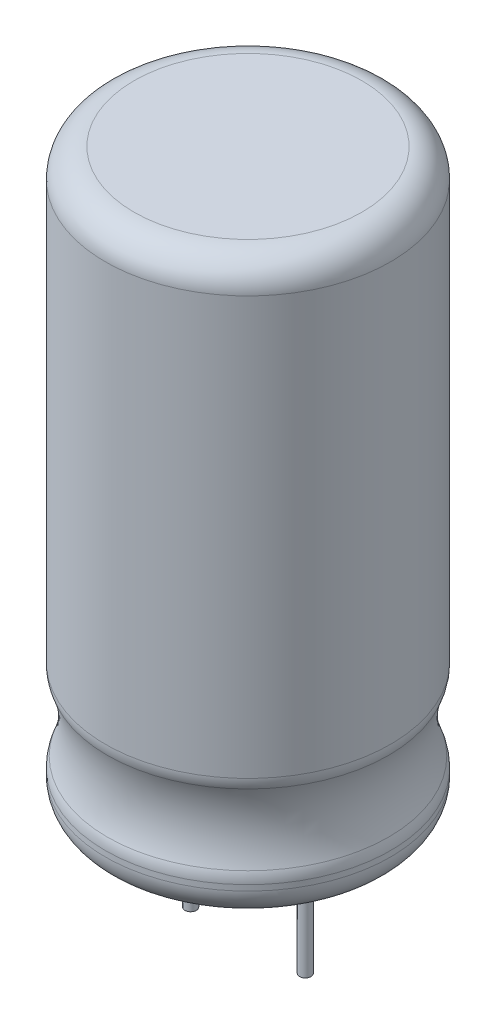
ISO-10303-21;
HEADER;
FILE_DESCRIPTION(('STEP AP214'),'2;1');
FILE_NAME('part.step','',(''),(''),'','','');
FILE_SCHEMA(('AUTOMOTIVE_DESIGN { 1 0 10303 214 1 1 1 1 }'));
ENDSEC;
DATA;
#1=APPLICATION_CONTEXT('core data for automotive mechanical design processes');
#2=APPLICATION_PROTOCOL_DEFINITION('international standard','automotive_design',2000,#1);
#3=PRODUCT_CONTEXT('',#1,'mechanical');
#4=PRODUCT('Part','Part','',(#3));
#5=PRODUCT_RELATED_PRODUCT_CATEGORY('part','',(#4));
#6=PRODUCT_DEFINITION_FORMATION('','',#4);
#7=PRODUCT_DEFINITION_CONTEXT('part definition',#1,'design');
#8=PRODUCT_DEFINITION('design','',#6,#7);
#9=PRODUCT_DEFINITION_SHAPE('','',#8);
#10=(LENGTH_UNIT() NAMED_UNIT(*) SI_UNIT(.MILLI.,.METRE.));
#11=(NAMED_UNIT(*) PLANE_ANGLE_UNIT() SI_UNIT($,.RADIAN.));
#12=(NAMED_UNIT(*) SI_UNIT($,.STERADIAN.) SOLID_ANGLE_UNIT());
#13=UNCERTAINTY_MEASURE_WITH_UNIT(LENGTH_MEASURE(1.E-05),#10,'distance_accuracy_value','');
#14=(GEOMETRIC_REPRESENTATION_CONTEXT(3) GLOBAL_UNCERTAINTY_ASSIGNED_CONTEXT((#13)) GLOBAL_UNIT_ASSIGNED_CONTEXT((#10,
#11,#12)) REPRESENTATION_CONTEXT('',''));
#15=CARTESIAN_POINT('',(0.,0.,0.));
#16=DIRECTION('',(0.,0.,1.));
#17=DIRECTION('',(1.,0.,0.));
#18=AXIS2_PLACEMENT_3D('',#15,#16,#17);
#19=CARTESIAN_POINT('',(-2.54,-5.08,0.));
#20=DIRECTION('',(0.,-1.,0.));
#21=DIRECTION('',(0.,0.,-1.));
#22=AXIS2_PLACEMENT_3D('',#19,#20,#21);
#23=PLANE('',#22);
#24=CARTESIAN_POINT('',(-2.54,-5.08,0.));
#25=DIRECTION('',(0.,1.,0.));
#26=DIRECTION('',(0.,0.,1.));
#27=AXIS2_PLACEMENT_3D('',#24,#25,#26);
#28=CIRCLE('',#27,0.254000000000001);
#29=CARTESIAN_POINT('',(-2.54,-5.08,0.254000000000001));
#30=VERTEX_POINT('',#29);
#31=EDGE_CURVE('E144',#30,#30,#28,.T.);
#32=ORIENTED_EDGE('',*,*,#31,.F.);
#33=EDGE_LOOP('',(#32));
#34=FACE_BOUND('',#33,.T.);
#35=ADVANCED_FACE('F14',(#34),#23,.T.);
#36=CARTESIAN_POINT('',(2.54,-5.08,0.));
#37=DIRECTION('',(0.,-1.,0.));
#38=DIRECTION('',(0.,0.,-1.));
#39=AXIS2_PLACEMENT_3D('',#36,#37,#38);
#40=PLANE('',#39);
#41=CARTESIAN_POINT('',(2.54,-5.08,0.));
#42=DIRECTION('',(0.,1.,0.));
#43=DIRECTION('',(0.,0.,1.));
#44=AXIS2_PLACEMENT_3D('',#41,#42,#43);
#45=CIRCLE('',#44,0.254000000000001);
#46=CARTESIAN_POINT('',(2.54,-5.08,0.254000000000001));
#47=VERTEX_POINT('',#46);
#48=EDGE_CURVE('E141',#47,#47,#45,.T.);
#49=ORIENTED_EDGE('',*,*,#48,.F.);
#50=EDGE_LOOP('',(#49));
#51=FACE_BOUND('',#50,.T.);
#52=ADVANCED_FACE('F339',(#51),#40,.T.);
#53=CARTESIAN_POINT('',(-2.54,-5.08,0.));
#54=DIRECTION('',(0.,1.,0.));
#55=DIRECTION('',(0.,0.,1.));
#56=AXIS2_PLACEMENT_3D('',#53,#54,#55);
#57=CYLINDRICAL_SURFACE('',#56,0.254000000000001);
#58=CARTESIAN_POINT('',(-2.54,0.,0.));
#59=DIRECTION('',(0.,1.,0.));
#60=DIRECTION('',(0.,0.,1.));
#61=AXIS2_PLACEMENT_3D('',#58,#59,#60);
#62=CIRCLE('',#61,0.254000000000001);
#63=CARTESIAN_POINT('',(-2.54,0.,0.254000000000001));
#64=VERTEX_POINT('',#63);
#65=EDGE_CURVE('E74',#64,#64,#62,.T.);
#66=ORIENTED_EDGE('',*,*,#65,.F.);
#67=EDGE_LOOP('',(#66));
#68=FACE_BOUND('',#67,.T.);
#69=ORIENTED_EDGE('',*,*,#31,.T.);
#70=EDGE_LOOP('',(#69));
#71=FACE_BOUND('',#70,.T.);
#72=ADVANCED_FACE('F328',(#68,#71),#57,.T.);
#73=CARTESIAN_POINT('',(2.54,-5.08,0.));
#74=DIRECTION('',(0.,1.,0.));
#75=DIRECTION('',(0.,0.,1.));
#76=AXIS2_PLACEMENT_3D('',#73,#74,#75);
#77=CYLINDRICAL_SURFACE('',#76,0.254000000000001);
#78=CARTESIAN_POINT('',(2.54,0.,0.));
#79=DIRECTION('',(0.,1.,0.));
#80=DIRECTION('',(0.,0.,1.));
#81=AXIS2_PLACEMENT_3D('',#78,#79,#80);
#82=CIRCLE('',#81,0.254000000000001);
#83=CARTESIAN_POINT('',(2.54,0.,0.254000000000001));
#84=VERTEX_POINT('',#83);
#85=EDGE_CURVE('E123',#84,#84,#82,.T.);
#86=ORIENTED_EDGE('',*,*,#85,.F.);
#87=EDGE_LOOP('',(#86));
#88=FACE_BOUND('',#87,.T.);
#89=ORIENTED_EDGE('',*,*,#48,.T.);
#90=EDGE_LOOP('',(#89));
#91=FACE_BOUND('',#90,.T.);
#92=ADVANCED_FACE('F99',(#88,#91),#77,.T.);
#93=CARTESIAN_POINT('',(-3.159125,0.,0.));
#94=DIRECTION('',(0.,-1.,0.));
#95=DIRECTION('',(0.,0.,-1.));
#96=AXIS2_PLACEMENT_3D('',#93,#94,#95);
#97=PLANE('',#96);
#98=ORIENTED_EDGE('',*,*,#85,.T.);
#99=EDGE_LOOP('',(#98));
#100=FACE_BOUND('',#99,.T.);
#101=CARTESIAN_POINT('',(0.,0.,0.));
#102=DIRECTION('',(0.,1.,0.));
#103=DIRECTION('',(0.,0.,-1.));
#104=AXIS2_PLACEMENT_3D('',#101,#102,#103);
#105=CIRCLE('',#104,5.04825);
#106=CARTESIAN_POINT('',(-4.36270879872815,0.,-2.54));
#107=VERTEX_POINT('',#106);
#108=CARTESIAN_POINT('',(0.,0.,-5.04825));
#109=VERTEX_POINT('',#108);
#110=EDGE_CURVE('E61',#107,#109,#105,.F.);
#111=ORIENTED_EDGE('',*,*,#110,.T.);
#112=CARTESIAN_POINT('',(0.,0.,0.));
#113=DIRECTION('',(0.,1.,0.));
#114=DIRECTION('',(0.864202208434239,0.,-0.503144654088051));
#115=AXIS2_PLACEMENT_3D('',#112,#113,#114);
#116=CIRCLE('',#115,5.04825);
#117=CARTESIAN_POINT('',(4.36270879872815,0.,-2.54));
#118=VERTEX_POINT('',#117);
#119=EDGE_CURVE('E71',#109,#118,#116,.F.);
#120=ORIENTED_EDGE('',*,*,#119,.T.);
#121=CARTESIAN_POINT('',(0.,0.,0.));
#122=DIRECTION('',(0.,1.,0.));
#123=DIRECTION('',(0.864202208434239,0.,0.50314465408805));
#124=AXIS2_PLACEMENT_3D('',#121,#122,#123);
#125=CIRCLE('',#124,5.04825);
#126=CARTESIAN_POINT('',(4.36270879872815,0.,2.54));
#127=VERTEX_POINT('',#126);
#128=EDGE_CURVE('E82',#127,#118,#125,.T.);
#129=ORIENTED_EDGE('',*,*,#128,.F.);
#130=CARTESIAN_POINT('',(0.,0.,0.));
#131=DIRECTION('',(0.,1.,0.));
#132=DIRECTION('',(-0.864202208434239,0.,0.50314465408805));
#133=AXIS2_PLACEMENT_3D('',#130,#131,#132);
#134=CIRCLE('',#133,5.04825);
#135=CARTESIAN_POINT('',(-4.36270879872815,0.,2.54));
#136=VERTEX_POINT('',#135);
#137=EDGE_CURVE('E80',#136,#127,#134,.T.);
#138=ORIENTED_EDGE('',*,*,#137,.F.);
#139=CARTESIAN_POINT('',(0.,0.,0.));
#140=DIRECTION('',(0.,1.,0.));
#141=DIRECTION('',(-0.864202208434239,0.,-0.50314465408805));
#142=AXIS2_PLACEMENT_3D('',#139,#140,#141);
#143=CIRCLE('',#142,5.04825);
#144=EDGE_CURVE('E67',#107,#136,#143,.T.);
#145=ORIENTED_EDGE('',*,*,#144,.F.);
#146=EDGE_LOOP('',(#111,#120,#129,#138,#145));
#147=FACE_BOUND('',#146,.T.);
#148=ORIENTED_EDGE('',*,*,#65,.T.);
#149=EDGE_LOOP('',(#148));
#150=FACE_BOUND('',#149,.T.);
#151=ADVANCED_FACE('F78',(#100,#147,#150),#97,.T.);
#152=CARTESIAN_POINT('',(0.,1.27,0.));
#153=DIRECTION('',(0.,-1.,0.));
#154=DIRECTION('',(0.,0.,-1.));
#155=AXIS2_PLACEMENT_3D('',#152,#153,#154);
#156=TOROIDAL_SURFACE('',#155,5.04825000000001,1.27);
#157=ORIENTED_EDGE('',*,*,#119,.F.);
#158=ORIENTED_EDGE('',*,*,#110,.F.);
#159=ORIENTED_EDGE('',*,*,#144,.T.);
#160=ORIENTED_EDGE('',*,*,#137,.T.);
#161=ORIENTED_EDGE('',*,*,#128,.T.);
#162=EDGE_LOOP('',(#157,#158,#159,#160,#161));
#163=FACE_BOUND('',#162,.T.);
#164=CARTESIAN_POINT('',(0.,1.27000000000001,0.));
#165=DIRECTION('',(0.,-1.,0.));
#166=DIRECTION('',(0.,0.,-1.));
#167=AXIS2_PLACEMENT_3D('',#164,#165,#166);
#168=CIRCLE('',#167,6.31825000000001);
#169=CARTESIAN_POINT('',(0.,1.27000000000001,-6.31825000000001));
#170=VERTEX_POINT('',#169);
#171=EDGE_CURVE('E125',#170,#170,#168,.F.);
#172=ORIENTED_EDGE('',*,*,#171,.F.);
#173=EDGE_LOOP('',(#172));
#174=FACE_BOUND('',#173,.T.);
#175=ADVANCED_FACE('F64',(#163,#174),#156,.T.);
#176=CARTESIAN_POINT('',(0.,0.,0.));
#177=DIRECTION('',(0.,-1.,0.));
#178=DIRECTION('',(0.,0.,-1.));
#179=AXIS2_PLACEMENT_3D('',#176,#177,#178);
#180=CYLINDRICAL_SURFACE('',#179,6.31825000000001);
#181=CARTESIAN_POINT('',(0.,1.51781669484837,0.));
#182=DIRECTION('',(0.,1.,0.));
#183=DIRECTION('',(0.,0.,1.));
#184=AXIS2_PLACEMENT_3D('',#181,#182,#183);
#185=CIRCLE('',#184,6.31825000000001);
#186=CARTESIAN_POINT('',(0.,1.51781669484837,6.31825000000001));
#187=VERTEX_POINT('',#186);
#188=EDGE_CURVE('E197',#187,#187,#185,.T.);
#189=ORIENTED_EDGE('',*,*,#188,.F.);
#190=EDGE_LOOP('',(#189));
#191=FACE_BOUND('',#190,.T.);
#192=ORIENTED_EDGE('',*,*,#171,.T.);
#193=EDGE_LOOP('',(#192));
#194=FACE_BOUND('',#193,.T.);
#195=ADVANCED_FACE('F308',(#191,#194),#180,.T.);
#196=CARTESIAN_POINT('',(0.,1.51781669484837,0.));
#197=DIRECTION('',(0.,1.,0.));
#198=DIRECTION('',(0.,0.,1.));
#199=AXIS2_PLACEMENT_3D('',#196,#197,#198);
#200=TOROIDAL_SURFACE('',#199,5.04825000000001,1.27);
#201=CARTESIAN_POINT('',(0.,1.98768588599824,0.));
#202=DIRECTION('',(0.,-1.,0.));
#203=DIRECTION('',(0.,0.,-1.));
#204=AXIS2_PLACEMENT_3D('',#201,#202,#203);
#205=CIRCLE('',#204,6.22813259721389);
#206=CARTESIAN_POINT('',(0.,1.98768588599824,-6.22813259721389));
#207=VERTEX_POINT('',#206);
#208=EDGE_CURVE('E194',#207,#207,#205,.T.);
#209=ORIENTED_EDGE('',*,*,#208,.T.);
#210=EDGE_LOOP('',(#209));
#211=FACE_BOUND('',#210,.T.);
#212=ORIENTED_EDGE('',*,*,#188,.T.);
#213=EDGE_LOOP('',(#212));
#214=FACE_BOUND('',#213,.T.);
#215=ADVANCED_FACE('F212',(#211,#214),#200,.T.);
#216=CARTESIAN_POINT('',(0.,3.556,0.));
#217=DIRECTION('',(0.,-1.,0.));
#218=DIRECTION('',(0.,0.,-1.));
#219=AXIS2_PLACEMENT_3D('',#216,#217,#218);
#220=TOROIDAL_SURFACE('',#219,10.1663063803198,4.23896472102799);
#221=ORIENTED_EDGE('',*,*,#208,.F.);
#222=EDGE_LOOP('',(#221));
#223=FACE_BOUND('',#222,.T.);
#224=CARTESIAN_POINT('',(0.,5.12431411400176,0.));
#225=DIRECTION('',(0.,1.,0.));
#226=DIRECTION('',(0.,0.,1.));
#227=AXIS2_PLACEMENT_3D('',#224,#225,#226);
#228=CIRCLE('',#227,6.22813259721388);
#229=CARTESIAN_POINT('',(0.,5.12431411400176,6.22813259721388));
#230=VERTEX_POINT('',#229);
#231=EDGE_CURVE('E174',#230,#230,#228,.T.);
#232=ORIENTED_EDGE('',*,*,#231,.F.);
#233=EDGE_LOOP('',(#232));
#234=FACE_BOUND('',#233,.T.);
#235=ADVANCED_FACE('F208',(#223,#234),#220,.F.);
#236=CARTESIAN_POINT('',(-3.159125,25.3746,0.));
#237=DIRECTION('',(0.,-1.,0.));
#238=DIRECTION('',(0.,0.,-1.));
#239=AXIS2_PLACEMENT_3D('',#236,#237,#238);
#240=PLANE('',#239);
#241=CARTESIAN_POINT('',(0.,25.3746,0.));
#242=DIRECTION('',(0.,-1.,0.));
#243=DIRECTION('',(0.,0.,-1.));
#244=AXIS2_PLACEMENT_3D('',#241,#242,#243);
#245=CIRCLE('',#244,5.04825);
#246=CARTESIAN_POINT('',(0.,25.3746,-5.04825));
#247=VERTEX_POINT('',#246);
#248=CARTESIAN_POINT('',(4.36270879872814,25.3746,-2.54));
#249=VERTEX_POINT('',#248);
#250=EDGE_CURVE('E190',#247,#249,#245,.T.);
#251=ORIENTED_EDGE('',*,*,#250,.F.);
#252=CARTESIAN_POINT('',(0.,25.3746,0.));
#253=DIRECTION('',(0.,-1.,0.));
#254=DIRECTION('',(-0.864202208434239,0.,-0.503144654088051));
#255=AXIS2_PLACEMENT_3D('',#252,#253,#254);
#256=CIRCLE('',#255,5.04824999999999);
#257=CARTESIAN_POINT('',(-4.36270879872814,25.3746,-2.54));
#258=VERTEX_POINT('',#257);
#259=EDGE_CURVE('E191',#258,#247,#256,.T.);
#260=ORIENTED_EDGE('',*,*,#259,.F.);
#261=CARTESIAN_POINT('',(0.,25.3746,0.));
#262=DIRECTION('',(0.,-1.,0.));
#263=DIRECTION('',(-0.864202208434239,0.,0.50314465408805));
#264=AXIS2_PLACEMENT_3D('',#261,#262,#263);
#265=CIRCLE('',#264,5.04824999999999);
#266=CARTESIAN_POINT('',(-4.36270879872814,25.3746,2.54));
#267=VERTEX_POINT('',#266);
#268=EDGE_CURVE('E35',#267,#258,#265,.T.);
#269=ORIENTED_EDGE('',*,*,#268,.F.);
#270=CARTESIAN_POINT('',(0.,25.3746,0.));
#271=DIRECTION('',(0.,-1.,0.));
#272=DIRECTION('',(0.864202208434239,0.,0.50314465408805));
#273=AXIS2_PLACEMENT_3D('',#270,#271,#272);
#274=CIRCLE('',#273,5.04824999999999);
#275=CARTESIAN_POINT('',(4.36270879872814,25.3746,2.53999999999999));
#276=VERTEX_POINT('',#275);
#277=EDGE_CURVE('E178',#276,#267,#274,.T.);
#278=ORIENTED_EDGE('',*,*,#277,.F.);
#279=CARTESIAN_POINT('',(0.,25.3746,0.));
#280=DIRECTION('',(0.,-1.,0.));
#281=DIRECTION('',(0.864202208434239,0.,-0.503144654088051));
#282=AXIS2_PLACEMENT_3D('',#279,#280,#281);
#283=CIRCLE('',#282,5.04824999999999);
#284=EDGE_CURVE('E151',#249,#276,#283,.T.);
#285=ORIENTED_EDGE('',*,*,#284,.F.);
#286=EDGE_LOOP('',(#251,#260,#269,#278,#285));
#287=FACE_BOUND('',#286,.T.);
#288=ADVANCED_FACE('F211',(#287),#240,.F.);
#289=CARTESIAN_POINT('',(0.,5.59418330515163,0.));
#290=DIRECTION('',(0.,1.,0.));
#291=DIRECTION('',(0.,0.,1.));
#292=AXIS2_PLACEMENT_3D('',#289,#290,#291);
#293=TOROIDAL_SURFACE('',#292,5.04825,1.27);
#294=CARTESIAN_POINT('',(0.,5.59418330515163,0.));
#295=DIRECTION('',(0.,-1.,0.));
#296=DIRECTION('',(0.,0.,-1.));
#297=AXIS2_PLACEMENT_3D('',#294,#295,#296);
#298=CIRCLE('',#297,6.31825);
#299=CARTESIAN_POINT('',(0.,5.59418330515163,-6.31825));
#300=VERTEX_POINT('',#299);
#301=EDGE_CURVE('E26',#300,#300,#298,.F.);
#302=ORIENTED_EDGE('',*,*,#301,.F.);
#303=EDGE_LOOP('',(#302));
#304=FACE_BOUND('',#303,.T.);
#305=ORIENTED_EDGE('',*,*,#231,.T.);
#306=EDGE_LOOP('',(#305));
#307=FACE_BOUND('',#306,.T.);
#308=ADVANCED_FACE('F166',(#304,#307),#293,.T.);
#309=CARTESIAN_POINT('',(0.,24.1046,0.));
#310=DIRECTION('',(0.,-1.,0.));
#311=DIRECTION('',(0.,0.,-1.));
#312=AXIS2_PLACEMENT_3D('',#309,#310,#311);
#313=TOROIDAL_SURFACE('',#312,5.04825,1.27);
#314=CARTESIAN_POINT('',(0.,24.1046,0.));
#315=DIRECTION('',(0.,-1.,0.));
#316=DIRECTION('',(0.,0.,-1.));
#317=AXIS2_PLACEMENT_3D('',#314,#315,#316);
#318=CIRCLE('',#317,6.31825);
#319=CARTESIAN_POINT('',(0.,24.1046,-6.31825));
#320=VERTEX_POINT('',#319);
#321=EDGE_CURVE('E9',#320,#320,#318,.T.);
#322=ORIENTED_EDGE('',*,*,#321,.F.);
#323=EDGE_LOOP('',(#322));
#324=FACE_BOUND('',#323,.T.);
#325=ORIENTED_EDGE('',*,*,#259,.T.);
#326=ORIENTED_EDGE('',*,*,#250,.T.);
#327=ORIENTED_EDGE('',*,*,#284,.T.);
#328=ORIENTED_EDGE('',*,*,#277,.T.);
#329=ORIENTED_EDGE('',*,*,#268,.T.);
#330=EDGE_LOOP('',(#325,#326,#327,#328,#329));
#331=FACE_BOUND('',#330,.T.);
#332=ADVANCED_FACE('F156',(#324,#331),#313,.T.);
#333=CARTESIAN_POINT('',(0.,0.,0.));
#334=DIRECTION('',(0.,-1.,0.));
#335=DIRECTION('',(0.,0.,-1.));
#336=AXIS2_PLACEMENT_3D('',#333,#334,#335);
#337=CYLINDRICAL_SURFACE('',#336,6.31825);
#338=ORIENTED_EDGE('',*,*,#301,.T.);
#339=EDGE_LOOP('',(#338));
#340=FACE_BOUND('',#339,.T.);
#341=ORIENTED_EDGE('',*,*,#321,.T.);
#342=EDGE_LOOP('',(#341));
#343=FACE_BOUND('',#342,.T.);
#344=ADVANCED_FACE('F16',(#340,#343),#337,.T.);
#345=CLOSED_SHELL('',(#35,#52,#72,#92,#151,#175,#195,#215,#235,#288,#308,#332,#344));
#346=MANIFOLD_SOLID_BREP('B1',#345);
#347=ADVANCED_BREP_SHAPE_REPRESENTATION('',(#18,#346),#14);
#348=SHAPE_DEFINITION_REPRESENTATION(#9,#347);
ENDSEC;
END-ISO-10303-21;
